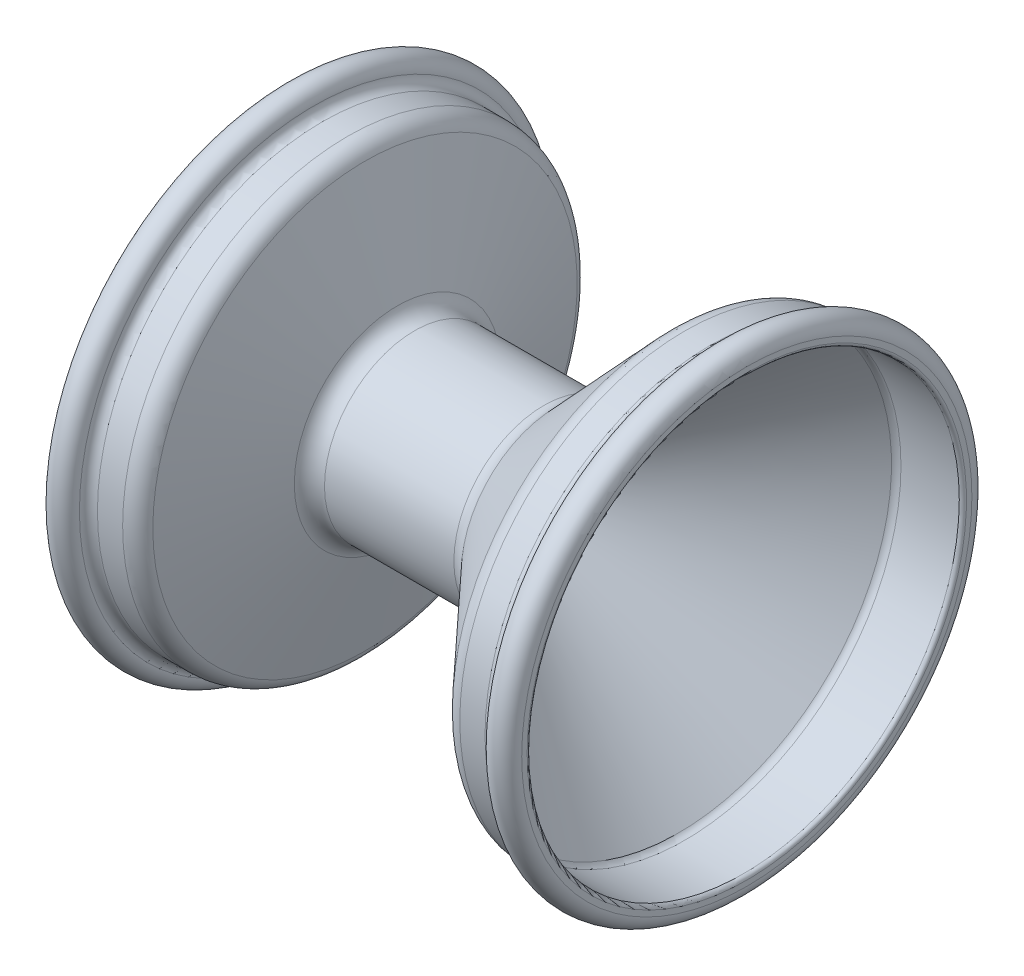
ISO-10303-21;
HEADER;
FILE_DESCRIPTION(('STEP AP214'),'2;1');
FILE_NAME('part.step','',(''),(''),'','','');
FILE_SCHEMA(('AUTOMOTIVE_DESIGN { 1 0 10303 214 1 1 1 1 }'));
ENDSEC;
DATA;
#1=APPLICATION_CONTEXT('core data for automotive mechanical design processes');
#2=APPLICATION_PROTOCOL_DEFINITION('international standard','automotive_design',2000,#1);
#3=PRODUCT_CONTEXT('',#1,'mechanical');
#4=PRODUCT('Part','Part','',(#3));
#5=PRODUCT_RELATED_PRODUCT_CATEGORY('part','',(#4));
#6=PRODUCT_DEFINITION_FORMATION('','',#4);
#7=PRODUCT_DEFINITION_CONTEXT('part definition',#1,'design');
#8=PRODUCT_DEFINITION('design','',#6,#7);
#9=PRODUCT_DEFINITION_SHAPE('','',#8);
#10=(LENGTH_UNIT() NAMED_UNIT(*) SI_UNIT(.MILLI.,.METRE.));
#11=(NAMED_UNIT(*) PLANE_ANGLE_UNIT() SI_UNIT($,.RADIAN.));
#12=(NAMED_UNIT(*) SI_UNIT($,.STERADIAN.) SOLID_ANGLE_UNIT());
#13=UNCERTAINTY_MEASURE_WITH_UNIT(LENGTH_MEASURE(1.E-05),#10,'distance_accuracy_value','');
#14=(GEOMETRIC_REPRESENTATION_CONTEXT(3) GLOBAL_UNCERTAINTY_ASSIGNED_CONTEXT((#13)) GLOBAL_UNIT_ASSIGNED_CONTEXT((#10,
#11,#12)) REPRESENTATION_CONTEXT('',''));
#15=CARTESIAN_POINT('',(0.,0.,0.));
#16=DIRECTION('',(0.,0.,1.));
#17=DIRECTION('',(1.,0.,0.));
#18=AXIS2_PLACEMENT_3D('',#15,#16,#17);
#19=CARTESIAN_POINT('',(-87.8997406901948,0.,0.));
#20=DIRECTION('',(-1.,0.,0.));
#21=DIRECTION('',(0.,0.,1.));
#22=AXIS2_PLACEMENT_3D('',#19,#20,#21);
#23=TOROIDAL_SURFACE('',#22,65.,3.84453674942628);
#24=CARTESIAN_POINT('',(-84.0552039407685,0.,0.));
#25=DIRECTION('',(-1.,0.,0.));
#26=DIRECTION('',(0.,0.,1.));
#27=AXIS2_PLACEMENT_3D('',#24,#25,#26);
#28=CIRCLE('',#27,65.);
#29=CARTESIAN_POINT('',(-84.0552039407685,0.,65.));
#30=VERTEX_POINT('',#29);
#31=EDGE_CURVE('E38',#30,#30,#28,.T.);
#32=ORIENTED_EDGE('',*,*,#31,.T.);
#33=EDGE_LOOP('',(#32));
#34=FACE_BOUND('',#33,.T.);
#35=CARTESIAN_POINT('',(-91.7442774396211,0.,0.));
#36=DIRECTION('',(-1.,0.,0.));
#37=DIRECTION('',(0.,0.,1.));
#38=AXIS2_PLACEMENT_3D('',#35,#36,#37);
#39=CIRCLE('',#38,65.);
#40=CARTESIAN_POINT('',(-91.7442774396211,0.,65.));
#41=VERTEX_POINT('',#40);
#42=EDGE_CURVE('E132',#41,#41,#39,.T.);
#43=ORIENTED_EDGE('',*,*,#42,.F.);
#44=EDGE_LOOP('',(#43));
#45=FACE_BOUND('',#44,.T.);
#46=ADVANCED_FACE('F28',(#34,#45),#23,.T.);
#47=CARTESIAN_POINT('',(-81.5552039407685,0.,0.));
#48=DIRECTION('',(-1.,0.,0.));
#49=DIRECTION('',(0.,0.,1.));
#50=AXIS2_PLACEMENT_3D('',#47,#48,#49);
#51=TOROIDAL_SURFACE('',#50,65.,2.5);
#52=CARTESIAN_POINT('',(-81.5552039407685,0.,0.));
#53=DIRECTION('',(-1.,0.,0.));
#54=DIRECTION('',(0.,0.,1.));
#55=AXIS2_PLACEMENT_3D('',#52,#53,#54);
#56=CIRCLE('',#55,62.5);
#57=CARTESIAN_POINT('',(-81.5552039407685,0.,62.5));
#58=VERTEX_POINT('',#57);
#59=EDGE_CURVE('E42',#58,#58,#56,.T.);
#60=ORIENTED_EDGE('',*,*,#59,.T.);
#61=EDGE_LOOP('',(#60));
#62=FACE_BOUND('',#61,.T.);
#63=ORIENTED_EDGE('',*,*,#31,.F.);
#64=EDGE_LOOP('',(#63));
#65=FACE_BOUND('',#64,.T.);
#66=ADVANCED_FACE('F208',(#62,#65),#51,.F.);
#67=CARTESIAN_POINT('',(-112.,0.,0.));
#68=DIRECTION('',(-1.,0.,0.));
#69=DIRECTION('',(0.,0.,1.));
#70=AXIS2_PLACEMENT_3D('',#67,#68,#69);
#71=CYLINDRICAL_SURFACE('',#70,62.5);
#72=CARTESIAN_POINT('',(-74.5552039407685,0.,0.));
#73=DIRECTION('',(-1.,0.,0.));
#74=DIRECTION('',(0.,0.,1.));
#75=AXIS2_PLACEMENT_3D('',#72,#73,#74);
#76=CIRCLE('',#75,62.5);
#77=CARTESIAN_POINT('',(-74.5552039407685,0.,62.5));
#78=VERTEX_POINT('',#77);
#79=EDGE_CURVE('E46',#78,#78,#76,.T.);
#80=ORIENTED_EDGE('',*,*,#79,.T.);
#81=EDGE_LOOP('',(#80));
#82=FACE_BOUND('',#81,.T.);
#83=ORIENTED_EDGE('',*,*,#59,.F.);
#84=EDGE_LOOP('',(#83));
#85=FACE_BOUND('',#84,.T.);
#86=ADVANCED_FACE('F212',(#82,#85),#71,.T.);
#87=CARTESIAN_POINT('',(-74.5552039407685,0.,0.));
#88=DIRECTION('',(-1.,0.,0.));
#89=DIRECTION('',(0.,0.,1.));
#90=AXIS2_PLACEMENT_3D('',#87,#88,#89);
#91=TOROIDAL_SURFACE('',#90,57.5,5.);
#92=ORIENTED_EDGE('',*,*,#79,.F.);
#93=EDGE_LOOP('',(#92));
#94=FACE_BOUND('',#93,.T.);
#95=CARTESIAN_POINT('',(-69.7599227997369,0.,0.));
#96=DIRECTION('',(-1.,0.,0.));
#97=DIRECTION('',(0.,0.,1.));
#98=AXIS2_PLACEMENT_3D('',#95,#96,#97);
#99=CIRCLE('',#98,58.9160786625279);
#100=CARTESIAN_POINT('',(-69.7599227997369,0.,58.9160786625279));
#101=VERTEX_POINT('',#100);
#102=EDGE_CURVE('E51',#101,#101,#99,.T.);
#103=ORIENTED_EDGE('',*,*,#102,.T.);
#104=EDGE_LOOP('',(#103));
#105=FACE_BOUND('',#104,.T.);
#106=ADVANCED_FACE('F220',(#94,#105),#91,.T.);
#107=CARTESIAN_POINT('',(-69.7599227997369,0.,0.));
#108=DIRECTION('',(-1.,0.,0.));
#109=DIRECTION('',(0.,0.,1.));
#110=AXIS2_PLACEMENT_3D('',#107,#108,#109);
#111=CONICAL_SURFACE('',#110,58.9160786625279,1.28365085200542);
#112=CARTESIAN_POINT('',(-60.8026334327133,0.,0.));
#113=DIRECTION('',(-1.,0.,0.));
#114=DIRECTION('',(0.,0.,1.));
#115=AXIS2_PLACEMENT_3D('',#112,#113,#114);
#116=CIRCLE('',#115,28.5839213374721);
#117=CARTESIAN_POINT('',(-60.8026334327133,0.,28.5839213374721));
#118=VERTEX_POINT('',#117);
#119=EDGE_CURVE('E54',#118,#118,#116,.T.);
#120=ORIENTED_EDGE('',*,*,#119,.T.);
#121=EDGE_LOOP('',(#120));
#122=FACE_BOUND('',#121,.T.);
#123=ORIENTED_EDGE('',*,*,#102,.F.);
#124=EDGE_LOOP('',(#123));
#125=FACE_BOUND('',#124,.T.);
#126=ADVANCED_FACE('F227',(#122,#125),#111,.T.);
#127=CARTESIAN_POINT('',(-56.0073522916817,0.,0.));
#128=DIRECTION('',(-1.,0.,0.));
#129=DIRECTION('',(0.,0.,1.));
#130=AXIS2_PLACEMENT_3D('',#127,#128,#129);
#131=TOROIDAL_SURFACE('',#130,30.,5.);
#132=ORIENTED_EDGE('',*,*,#119,.F.);
#133=EDGE_LOOP('',(#132));
#134=FACE_BOUND('',#133,.T.);
#135=CARTESIAN_POINT('',(-56.0073522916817,0.,0.));
#136=DIRECTION('',(-1.,0.,0.));
#137=DIRECTION('',(0.,0.,1.));
#138=AXIS2_PLACEMENT_3D('',#135,#136,#137);
#139=CIRCLE('',#138,25.);
#140=CARTESIAN_POINT('',(-56.0073522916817,0.,25.));
#141=VERTEX_POINT('',#140);
#142=EDGE_CURVE('E57',#141,#141,#139,.T.);
#143=ORIENTED_EDGE('',*,*,#142,.T.);
#144=EDGE_LOOP('',(#143));
#145=FACE_BOUND('',#144,.T.);
#146=ADVANCED_FACE('F231',(#134,#145),#131,.F.);
#147=CARTESIAN_POINT('',(-112.,0.,0.));
#148=DIRECTION('',(-1.,0.,0.));
#149=DIRECTION('',(0.,0.,1.));
#150=AXIS2_PLACEMENT_3D('',#147,#148,#149);
#151=CYLINDRICAL_SURFACE('',#150,25.);
#152=CARTESIAN_POINT('',(-20.0902180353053,0.,0.));
#153=DIRECTION('',(-1.,0.,0.));
#154=DIRECTION('',(0.,0.,1.));
#155=AXIS2_PLACEMENT_3D('',#152,#153,#154);
#156=CIRCLE('',#155,25.);
#157=CARTESIAN_POINT('',(-20.0902180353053,0.,25.));
#158=VERTEX_POINT('',#157);
#159=EDGE_CURVE('E60',#158,#158,#156,.T.);
#160=ORIENTED_EDGE('',*,*,#159,.T.);
#161=EDGE_LOOP('',(#160));
#162=FACE_BOUND('',#161,.T.);
#163=ORIENTED_EDGE('',*,*,#142,.F.);
#164=EDGE_LOOP('',(#163));
#165=FACE_BOUND('',#164,.T.);
#166=ADVANCED_FACE('F235',(#162,#165),#151,.T.);
#167=CARTESIAN_POINT('',(-20.0902180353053,0.,0.));
#168=DIRECTION('',(-1.,0.,0.));
#169=DIRECTION('',(0.,0.,1.));
#170=AXIS2_PLACEMENT_3D('',#167,#168,#169);
#171=TOROIDAL_SURFACE('',#170,30.,5.);
#172=ORIENTED_EDGE('',*,*,#159,.F.);
#173=EDGE_LOOP('',(#172));
#174=FACE_BOUND('',#173,.T.);
#175=CARTESIAN_POINT('',(-16.4249052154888,0.,0.));
#176=DIRECTION('',(-1.,0.,0.));
#177=DIRECTION('',(0.,0.,1.));
#178=AXIS2_PLACEMENT_3D('',#175,#176,#177);
#179=CIRCLE('',#178,26.5991939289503);
#180=CARTESIAN_POINT('',(-16.4249052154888,0.,26.5991939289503));
#181=VERTEX_POINT('',#180);
#182=EDGE_CURVE('E63',#181,#181,#179,.T.);
#183=ORIENTED_EDGE('',*,*,#182,.T.);
#184=EDGE_LOOP('',(#183));
#185=FACE_BOUND('',#184,.T.);
#186=ADVANCED_FACE('F239',(#174,#185),#171,.F.);
#187=CARTESIAN_POINT('',(15.4013362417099,0.,0.));
#188=DIRECTION('',(1.,0.,0.));
#189=DIRECTION('',(0.,0.,-1.));
#190=AXIS2_PLACEMENT_3D('',#187,#188,#189);
#191=CONICAL_SURFACE('',#190,60.9008060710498,0.822813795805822);
#192=CARTESIAN_POINT('',(3.09529375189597,47.5069200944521,-3.52649661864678));
#193=CARTESIAN_POINT('',(3.16622375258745,47.5761889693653,-3.62602737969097));
#194=CARTESIAN_POINT('',(3.23997912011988,47.6485423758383,-3.72137158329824));
#195=CARTESIAN_POINT('',(3.39258074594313,47.7990224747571,-3.90307311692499));
#196=CARTESIAN_POINT('',(3.47142827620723,47.8771506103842,-3.98942818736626));
#197=CARTESIAN_POINT('',(3.63362811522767,48.0387461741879,-4.15257100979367));
#198=CARTESIAN_POINT('',(3.71698416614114,48.1222180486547,-4.22935063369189));
#199=CARTESIAN_POINT('',(3.88751385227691,48.29394834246,-4.37273938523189));
#200=CARTESIAN_POINT('',(3.97468886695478,48.3822084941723,-4.43934479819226));
#201=CARTESIAN_POINT('',(4.15208372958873,48.5628505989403,-4.56182924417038));
#202=CARTESIAN_POINT('',(4.24230129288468,48.6552294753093,-4.61771612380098));
#203=CARTESIAN_POINT('',(4.42518569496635,48.8435946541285,-4.71844233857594));
#204=CARTESIAN_POINT('',(4.51785342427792,48.9395822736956,-4.76327759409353));
#205=CARTESIAN_POINT('',(4.70485059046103,49.1344245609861,-4.84152687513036));
#206=CARTESIAN_POINT('',(4.79917896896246,49.2332774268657,-4.87494791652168));
#207=CARTESIAN_POINT('',(4.9888904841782,49.4332630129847,-4.93017633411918));
#208=CARTESIAN_POINT('',(5.08427399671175,49.5343965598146,-4.95197942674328));
#209=CARTESIAN_POINT('',(5.27519117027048,49.7380094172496,-4.98376646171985));
#210=CARTESIAN_POINT('',(5.37072422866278,49.8404858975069,-4.9937721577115));
#211=CARTESIAN_POINT('',(5.56147149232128,50.0462757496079,-5.00196717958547));
#212=CARTESIAN_POINT('',(5.65668556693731,50.1495894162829,-5.00015214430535));
#213=CARTESIAN_POINT('',(5.84606215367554,50.3562339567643,-4.98471160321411));
#214=CARTESIAN_POINT('',(5.94022500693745,50.4595648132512,-4.97109004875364));
#215=CARTESIAN_POINT('',(6.1269207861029,50.6655589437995,-4.93213335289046));
#216=CARTESIAN_POINT('',(6.21945309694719,50.7682219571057,-4.90679388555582));
#217=CARTESIAN_POINT('',(6.40214031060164,50.9719802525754,-4.84461247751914));
#218=CARTESIAN_POINT('',(6.49229745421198,51.0730769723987,-4.80778183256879));
#219=CARTESIAN_POINT('',(6.66976570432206,51.2730837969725,-4.72286080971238));
#220=CARTESIAN_POINT('',(6.75707574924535,51.3719930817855,-4.67476628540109));
#221=CARTESIAN_POINT('',(6.92822503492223,51.566810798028,-4.56767877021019));
#222=CARTESIAN_POINT('',(7.01206552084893,51.6627203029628,-4.50868973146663));
#223=CARTESIAN_POINT('',(7.17578358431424,51.8508524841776,-4.38023103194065));
#224=CARTESIAN_POINT('',(7.25565968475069,51.9430737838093,-4.31075750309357));
#225=CARTESIAN_POINT('',(7.48877712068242,52.2133631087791,-4.08709081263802));
#226=CARTESIAN_POINT('',(7.63539272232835,52.3849254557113,-3.91772368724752));
#227=CARTESIAN_POINT('',(7.90693743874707,52.7048844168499,-3.54365695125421));
#228=CARTESIAN_POINT('',(8.03186639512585,52.8532808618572,-3.33895708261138));
#229=CARTESIAN_POINT('',(8.25730766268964,53.1225402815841,-2.89960872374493));
#230=CARTESIAN_POINT('',(8.35778631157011,53.243365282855,-2.6649196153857));
#231=CARTESIAN_POINT('',(8.53168650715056,53.4533087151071,-2.17247839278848));
#232=CARTESIAN_POINT('',(8.60510817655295,53.5424272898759,-1.9147263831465));
#233=CARTESIAN_POINT('',(8.72311912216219,53.6860096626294,-1.38370389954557));
#234=CARTESIAN_POINT('',(8.76773380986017,53.7405040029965,-1.11044733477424));
#235=CARTESIAN_POINT('',(8.8271832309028,53.8131753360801,-0.555982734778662));
#236=CARTESIAN_POINT('',(8.84201831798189,53.831352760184,-0.274774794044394));
#237=CARTESIAN_POINT('',(8.84156240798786,53.8307946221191,0.287094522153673));
#238=CARTESIAN_POINT('',(8.82632316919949,53.8121224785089,0.567756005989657));
#239=CARTESIAN_POINT('',(8.76617855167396,53.7386044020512,1.12104619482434));
#240=CARTESIAN_POINT('',(8.721273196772,53.6837584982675,1.39367490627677));
#241=CARTESIAN_POINT('',(8.60285173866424,53.5396873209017,1.92315549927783));
#242=CARTESIAN_POINT('',(8.52933759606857,53.4504644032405,2.18000846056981));
#243=CARTESIAN_POINT('',(8.35542300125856,53.2405208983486,2.67070932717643));
#244=CARTESIAN_POINT('',(8.2550222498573,53.1197999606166,2.90455697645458));
#245=CARTESIAN_POINT('',(8.0295164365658,52.8504850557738,3.34303192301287));
#246=CARTESIAN_POINT('',(7.90437015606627,52.7018446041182,3.54760947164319));
#247=CARTESIAN_POINT('',(7.63248684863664,52.3815165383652,3.92130261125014));
#248=CARTESIAN_POINT('',(7.48574965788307,52.2098287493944,4.09041793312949));
#249=CARTESIAN_POINT('',(7.17412927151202,51.8485675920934,4.38855029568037));
#250=CARTESIAN_POINT('',(7.00922791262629,51.658976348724,4.51752669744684));
#251=CARTESIAN_POINT('',(6.66557890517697,51.2678835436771,4.73146781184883));
#252=CARTESIAN_POINT('',(6.48683137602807,51.0663820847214,4.81643290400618));
#253=CARTESIAN_POINT('',(6.12041002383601,50.6578150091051,4.93983286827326));
#254=CARTESIAN_POINT('',(5.93274766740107,50.4507566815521,4.97832591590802));
#255=CARTESIAN_POINT('',(5.5533932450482,50.0369486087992,5.00786127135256));
#256=CARTESIAN_POINT('',(5.36170123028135,49.8301988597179,4.99890418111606));
#257=CARTESIAN_POINT('',(4.98004897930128,49.4233175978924,4.93385765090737));
#258=CARTESIAN_POINT('',(4.79008624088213,49.2231748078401,4.87785335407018));
#259=CARTESIAN_POINT('',(4.41707809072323,48.834643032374,4.7204204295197));
#260=CARTESIAN_POINT('',(4.23403269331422,48.6462540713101,4.61899170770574));
#261=CARTESIAN_POINT('',(3.88033258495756,48.2861722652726,4.37359442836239));
#262=CARTESIAN_POINT('',(3.70968323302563,48.1144866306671,4.22960760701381));
#263=CARTESIAN_POINT('',(3.3860951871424,47.7921676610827,3.90304453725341));
#264=CARTESIAN_POINT('',(3.23315680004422,47.6415346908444,3.72046762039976));
#265=CARTESIAN_POINT('',(3.02074680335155,47.4341293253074,3.42162023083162));
#266=CARTESIAN_POINT('',(2.95268119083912,47.3679940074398,3.31765432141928));
#267=CARTESIAN_POINT('',(2.8228098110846,47.2423245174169,3.10211983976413));
#268=CARTESIAN_POINT('',(2.76100175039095,47.1827879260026,2.99055407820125));
#269=CARTESIAN_POINT('',(2.64414434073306,47.0706412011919,2.76055861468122));
#270=CARTESIAN_POINT('',(2.58909753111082,47.0180336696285,2.64212635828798));
#271=CARTESIAN_POINT('',(2.48627200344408,46.9200822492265,2.39931120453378));
#272=CARTESIAN_POINT('',(2.43849059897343,46.8747356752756,2.27493052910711));
#273=CARTESIAN_POINT('',(2.35055549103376,46.7915095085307,2.02096657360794));
#274=CARTESIAN_POINT('',(2.31040743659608,46.7536354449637,1.89137952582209));
#275=CARTESIAN_POINT('',(2.23814903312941,46.6856196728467,1.62805804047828));
#276=CARTESIAN_POINT('',(2.20603570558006,46.6554750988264,1.49432516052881));
#277=CARTESIAN_POINT('',(2.15010422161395,46.6030585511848,1.22357462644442));
#278=CARTESIAN_POINT('',(2.12628872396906,46.5807891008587,1.08655593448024));
#279=CARTESIAN_POINT('',(2.08718842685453,46.544265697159,0.810304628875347));
#280=CARTESIAN_POINT('',(2.0719004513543,46.5300087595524,0.671072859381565));
#281=CARTESIAN_POINT('',(2.05000142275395,46.5095960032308,0.391617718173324));
#282=CARTESIAN_POINT('',(2.04337325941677,46.5034242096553,0.251396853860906));
#283=CARTESIAN_POINT('',(2.03879863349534,46.4991639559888,-0.0292570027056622));
#284=CARTESIAN_POINT('',(2.04084895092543,46.5010724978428,-0.16968989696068));
#285=CARTESIAN_POINT('',(2.05360932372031,46.5129593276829,-0.449903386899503));
#286=CARTESIAN_POINT('',(2.06432457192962,46.5229424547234,-0.589683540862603));
#287=CARTESIAN_POINT('',(2.0943190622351,46.5509248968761,-0.867459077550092));
#288=CARTESIAN_POINT('',(2.11359515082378,46.5689212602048,-1.00545509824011));
#289=CARTESIAN_POINT('',(2.16053006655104,46.6128240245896,-1.27868972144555));
#290=CARTESIAN_POINT('',(2.18818619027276,46.6387278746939,-1.41392919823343));
#291=CARTESIAN_POINT('',(2.25162528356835,46.6982941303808,-1.68068837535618));
#292=CARTESIAN_POINT('',(2.28740529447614,46.7319537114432,-1.81220941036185));
#293=CARTESIAN_POINT('',(2.36675140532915,46.8068210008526,-2.07054849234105));
#294=CARTESIAN_POINT('',(2.41031100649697,46.8480224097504,-2.19737035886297));
#295=CARTESIAN_POINT('',(2.5048407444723,46.937746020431,-2.44549282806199));
#296=CARTESIAN_POINT('',(2.55580904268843,46.9862664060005,-2.56679479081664));
#297=CARTESIAN_POINT('',(2.68027376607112,47.1052196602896,-2.83676939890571));
#298=CARTESIAN_POINT('',(2.7560508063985,47.177956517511,-2.98338993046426));
#299=CARTESIAN_POINT('',(2.91810247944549,47.3344130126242,-3.26446531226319));
#300=CARTESIAN_POINT('',(3.00437713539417,47.4181326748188,-3.3989201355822));
#301=CARTESIAN_POINT('',(3.09529375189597,47.5069200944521,-3.52649661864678));
#302=B_SPLINE_CURVE_WITH_KNOTS('',3,(#192,#193,#194,#195,#196,#197,#198,#199,#200,#201,#202,
#203,#204,#205,#206,#207,#208,#209,#210,#211,#212,#213,#214,#215,#216,#217,#218,#219,#220,#221,
#222,#223,#224,#225,#226,#227,#228,#229,#230,#231,#232,#233,#234,#235,#236,#237,#238,#239,#240,
#241,#242,#243,#244,#245,#246,#247,#248,#249,#250,#251,#252,#253,#254,#255,#256,#257,#258,#259,
#260,#261,#262,#263,#264,#265,#266,#267,#268,#269,#270,#271,#272,#273,#274,#275,#276,#277,#278,
#279,#280,#281,#282,#283,#284,#285,#286,#287,#288,#289,#290,#291,#292,#293,#294,#295,#296,#297,
#298,#299,#300,#301),.UNSPECIFIED.,.T.,.F.,(4,2,2,2,2,2,2,2,2,2,2,2,2,2,2,2,2,2,2,2,2,2,2,2,2,2,
2,2,2,2,2,2,2,2,2,2,2,2,2,2,2,2,2,2,2,2,2,2,2,2,2,2,2,2,4),(0.,0.421293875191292,
0.842693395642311,1.26444821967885,1.6863566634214,2.10795505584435,2.52970884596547,
2.95120293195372,3.37285231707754,3.79372298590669,4.21474894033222,4.63563404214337,
5.05667464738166,5.47730266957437,5.89808577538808,6.3187165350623,6.73950286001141,
7.58163434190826,8.42377197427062,9.26706255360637,10.110349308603,10.9528911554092,
11.7954229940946,12.6365060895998,13.4775885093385,14.3186132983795,15.1596474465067,
16.0020944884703,16.8445479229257,17.687851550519,18.531147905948,19.3733874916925,
20.215616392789,21.056324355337,21.897034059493,22.7381050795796,23.5791906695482,
24.0010855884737,24.4228253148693,24.8447229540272,25.2664642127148,25.6885163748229,
26.1104118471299,26.5324423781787,26.9543156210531,27.3753540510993,27.7962362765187,
28.2173709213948,28.638350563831,29.0591945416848,29.4798854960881,29.9002266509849,
30.3204636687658,30.8604683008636,31.4004741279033),.UNSPECIFIED.);
#303=CARTESIAN_POINT('',(3.09529375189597,47.5069200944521,-3.52649661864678));
#304=VERTEX_POINT('',#303);
#305=EDGE_CURVE('E10',#304,#304,#302,.T.);
#306=ORIENTED_EDGE('',*,*,#305,.T.);
#307=EDGE_LOOP('',(#306));
#308=FACE_BOUND('',#307,.T.);
#309=ORIENTED_EDGE('',*,*,#182,.F.);
#310=EDGE_LOOP('',(#309));
#311=FACE_BOUND('',#310,.T.);
#312=CARTESIAN_POINT('',(15.4013362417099,0.,0.));
#313=DIRECTION('',(-1.,0.,0.));
#314=DIRECTION('',(0.,0.,1.));
#315=AXIS2_PLACEMENT_3D('',#312,#313,#314);
#316=CIRCLE('',#315,60.9008060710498);
#317=CARTESIAN_POINT('',(15.4013362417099,0.,60.9008060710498));
#318=VERTEX_POINT('',#317);
#319=EDGE_CURVE('E66',#318,#318,#316,.T.);
#320=ORIENTED_EDGE('',*,*,#319,.T.);
#321=EDGE_LOOP('',(#320));
#322=FACE_BOUND('',#321,.T.);
#323=ADVANCED_FACE('F242',(#308,#311,#322),#191,.T.);
#324=CARTESIAN_POINT('',(19.0666490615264,0.,0.));
#325=DIRECTION('',(-1.,0.,0.));
#326=DIRECTION('',(0.,0.,1.));
#327=AXIS2_PLACEMENT_3D('',#324,#325,#326);
#328=TOROIDAL_SURFACE('',#327,57.5,5.);
#329=ORIENTED_EDGE('',*,*,#319,.F.);
#330=EDGE_LOOP('',(#329));
#331=FACE_BOUND('',#330,.T.);
#332=CARTESIAN_POINT('',(19.0666490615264,0.,0.));
#333=DIRECTION('',(-1.,0.,0.));
#334=DIRECTION('',(0.,0.,1.));
#335=AXIS2_PLACEMENT_3D('',#332,#333,#334);
#336=CIRCLE('',#335,62.5);
#337=CARTESIAN_POINT('',(19.0666490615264,0.,62.5));
#338=VERTEX_POINT('',#337);
#339=EDGE_CURVE('E69',#338,#338,#336,.T.);
#340=ORIENTED_EDGE('',*,*,#339,.T.);
#341=EDGE_LOOP('',(#340));
#342=FACE_BOUND('',#341,.T.);
#343=ADVANCED_FACE('F247',(#331,#342),#328,.T.);
#344=CARTESIAN_POINT('',(-112.,0.,0.));
#345=DIRECTION('',(-1.,0.,0.));
#346=DIRECTION('',(0.,0.,1.));
#347=AXIS2_PLACEMENT_3D('',#344,#345,#346);
#348=CYLINDRICAL_SURFACE('',#347,62.5);
#349=ORIENTED_EDGE('',*,*,#339,.F.);
#350=EDGE_LOOP('',(#349));
#351=FACE_BOUND('',#350,.T.);
#352=CARTESIAN_POINT('',(26.0666490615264,0.,0.));
#353=DIRECTION('',(-1.,0.,0.));
#354=DIRECTION('',(0.,0.,1.));
#355=AXIS2_PLACEMENT_3D('',#352,#353,#354);
#356=CIRCLE('',#355,62.5);
#357=CARTESIAN_POINT('',(26.0666490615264,0.,62.5));
#358=VERTEX_POINT('',#357);
#359=EDGE_CURVE('E72',#358,#358,#356,.T.);
#360=ORIENTED_EDGE('',*,*,#359,.T.);
#361=EDGE_LOOP('',(#360));
#362=FACE_BOUND('',#361,.T.);
#363=ADVANCED_FACE('F250',(#351,#362),#348,.T.);
#364=CARTESIAN_POINT('',(26.0666490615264,0.,0.));
#365=DIRECTION('',(-1.,0.,0.));
#366=DIRECTION('',(0.,0.,1.));
#367=AXIS2_PLACEMENT_3D('',#364,#365,#366);
#368=TOROIDAL_SURFACE('',#367,65.,2.5);
#369=ORIENTED_EDGE('',*,*,#359,.F.);
#370=EDGE_LOOP('',(#369));
#371=FACE_BOUND('',#370,.T.);
#372=CARTESIAN_POINT('',(28.3798170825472,0.,0.));
#373=DIRECTION('',(-1.,0.,0.));
#374=DIRECTION('',(0.,0.,1.));
#375=AXIS2_PLACEMENT_3D('',#372,#373,#374);
#376=CIRCLE('',#375,64.0517101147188);
#377=CARTESIAN_POINT('',(28.3798170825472,0.,64.0517101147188));
#378=VERTEX_POINT('',#377);
#379=EDGE_CURVE('E75',#378,#378,#376,.T.);
#380=ORIENTED_EDGE('',*,*,#379,.T.);
#381=EDGE_LOOP('',(#380));
#382=FACE_BOUND('',#381,.T.);
#383=ADVANCED_FACE('F254',(#371,#382),#368,.F.);
#384=CARTESIAN_POINT('',(32.1649109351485,0.,0.));
#385=DIRECTION('',(-1.,0.,0.));
#386=DIRECTION('',(0.,0.,1.));
#387=AXIS2_PLACEMENT_3D('',#384,#385,#386);
#388=TOROIDAL_SURFACE('',#387,62.5,4.09081162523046);
#389=ORIENTED_EDGE('',*,*,#379,.F.);
#390=EDGE_LOOP('',(#389));
#391=FACE_BOUND('',#390,.T.);
#392=CARTESIAN_POINT('',(36.2557225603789,0.,0.));
#393=DIRECTION('',(-1.,0.,0.));
#394=DIRECTION('',(0.,0.,1.));
#395=AXIS2_PLACEMENT_3D('',#392,#393,#394);
#396=CIRCLE('',#395,62.5);
#397=CARTESIAN_POINT('',(36.2557225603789,0.,62.5));
#398=VERTEX_POINT('',#397);
#399=EDGE_CURVE('E78',#398,#398,#396,.T.);
#400=ORIENTED_EDGE('',*,*,#399,.T.);
#401=EDGE_LOOP('',(#400));
#402=FACE_BOUND('',#401,.T.);
#403=ADVANCED_FACE('F258',(#391,#402),#388,.T.);
#404=CARTESIAN_POINT('',(36.2557225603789,62.5,0.));
#405=DIRECTION('',(1.,0.,0.));
#406=DIRECTION('',(0.,0.,-1.));
#407=AXIS2_PLACEMENT_3D('',#404,#405,#406);
#408=PLANE('',#407);
#409=CARTESIAN_POINT('',(36.2557225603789,0.,0.));
#410=DIRECTION('',(-1.,0.,0.));
#411=DIRECTION('',(0.,0.,1.));
#412=AXIS2_PLACEMENT_3D('',#409,#410,#411);
#413=CIRCLE('',#412,61.);
#414=CARTESIAN_POINT('',(36.2557225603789,0.,61.));
#415=VERTEX_POINT('',#414);
#416=EDGE_CURVE('E81',#415,#415,#413,.T.);
#417=ORIENTED_EDGE('',*,*,#416,.T.);
#418=EDGE_LOOP('',(#417));
#419=FACE_BOUND('',#418,.T.);
#420=ORIENTED_EDGE('',*,*,#399,.F.);
#421=EDGE_LOOP('',(#420));
#422=FACE_BOUND('',#421,.T.);
#423=ADVANCED_FACE('F262',(#419,#422),#408,.T.);
#424=CARTESIAN_POINT('',(35.2557225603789,0.,0.));
#425=DIRECTION('',(-1.,0.,0.));
#426=DIRECTION('',(0.,0.,1.));
#427=AXIS2_PLACEMENT_3D('',#424,#425,#426);
#428=TOROIDAL_SURFACE('',#427,61.,0.999999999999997);
#429=ORIENTED_EDGE('',*,*,#416,.F.);
#430=EDGE_LOOP('',(#429));
#431=FACE_BOUND('',#430,.T.);
#432=CARTESIAN_POINT('',(35.2557225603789,0.,0.));
#433=DIRECTION('',(-1.,0.,0.));
#434=DIRECTION('',(0.,0.,1.));
#435=AXIS2_PLACEMENT_3D('',#432,#433,#434);
#436=CIRCLE('',#435,60.);
#437=CARTESIAN_POINT('',(35.2557225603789,0.,60.));
#438=VERTEX_POINT('',#437);
#439=EDGE_CURVE('E84',#438,#438,#436,.T.);
#440=ORIENTED_EDGE('',*,*,#439,.T.);
#441=EDGE_LOOP('',(#440));
#442=FACE_BOUND('',#441,.T.);
#443=ADVANCED_FACE('F266',(#431,#442),#428,.T.);
#444=CARTESIAN_POINT('',(-112.,0.,0.));
#445=DIRECTION('',(-1.,0.,0.));
#446=DIRECTION('',(0.,0.,1.));
#447=AXIS2_PLACEMENT_3D('',#444,#445,#446);
#448=CYLINDRICAL_SURFACE('',#447,60.);
#449=CARTESIAN_POINT('',(19.0666490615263,0.,0.));
#450=DIRECTION('',(-1.,0.,0.));
#451=DIRECTION('',(0.,0.,1.));
#452=AXIS2_PLACEMENT_3D('',#449,#450,#451);
#453=CIRCLE('',#452,60.);
#454=CARTESIAN_POINT('',(19.0666490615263,0.,60.));
#455=VERTEX_POINT('',#454);
#456=EDGE_CURVE('E87',#455,#455,#453,.T.);
#457=ORIENTED_EDGE('',*,*,#456,.T.);
#458=EDGE_LOOP('',(#457));
#459=FACE_BOUND('',#458,.T.);
#460=ORIENTED_EDGE('',*,*,#439,.F.);
#461=EDGE_LOOP('',(#460));
#462=FACE_BOUND('',#461,.T.);
#463=ADVANCED_FACE('F270',(#459,#462),#448,.F.);
#464=CARTESIAN_POINT('',(19.0666490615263,0.,0.));
#465=DIRECTION('',(-1.,0.,0.));
#466=DIRECTION('',(0.,0.,1.));
#467=AXIS2_PLACEMENT_3D('',#464,#465,#466);
#468=TOROIDAL_SURFACE('',#467,57.5,2.5);
#469=CARTESIAN_POINT('',(17.2339926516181,0.,0.));
#470=DIRECTION('',(-1.,0.,0.));
#471=DIRECTION('',(0.,0.,1.));
#472=AXIS2_PLACEMENT_3D('',#469,#470,#471);
#473=CIRCLE('',#472,59.2004030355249);
#474=CARTESIAN_POINT('',(17.2339926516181,0.,59.2004030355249));
#475=VERTEX_POINT('',#474);
#476=EDGE_CURVE('E90',#475,#475,#473,.T.);
#477=ORIENTED_EDGE('',*,*,#476,.T.);
#478=EDGE_LOOP('',(#477));
#479=FACE_BOUND('',#478,.T.);
#480=ORIENTED_EDGE('',*,*,#456,.F.);
#481=EDGE_LOOP('',(#480));
#482=FACE_BOUND('',#481,.T.);
#483=ADVANCED_FACE('F203',(#479,#482),#468,.F.);
#484=CARTESIAN_POINT('',(17.2339926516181,0.,0.));
#485=DIRECTION('',(1.,0.,0.));
#486=DIRECTION('',(0.,0.,-1.));
#487=AXIS2_PLACEMENT_3D('',#484,#485,#486);
#488=CONICAL_SURFACE('',#487,59.2004030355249,0.822813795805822);
#489=CARTESIAN_POINT('',(4.32004026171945,45.2186427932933,-2.3951850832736));
#490=CARTESIAN_POINT('',(4.36905776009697,45.2650117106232,-2.51856599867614));
#491=CARTESIAN_POINT('',(4.42177167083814,45.3150369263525,-2.63908332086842));
#492=CARTESIAN_POINT('',(4.53416349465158,45.422144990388,-2.87361199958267));
#493=CARTESIAN_POINT('',(4.59384318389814,45.4792296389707,-2.98762168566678));
#494=CARTESIAN_POINT('',(4.71969849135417,45.600169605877,-3.20838073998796));
#495=CARTESIAN_POINT('',(4.78587969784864,45.6640307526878,-3.31512372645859));
#496=CARTESIAN_POINT('',(4.92416512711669,45.798136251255,-3.52052610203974));
#497=CARTESIAN_POINT('',(4.99627150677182,45.8683829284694,-3.61918252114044));
#498=CARTESIAN_POINT('',(5.14572901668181,46.0147614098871,-3.80759089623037));
#499=CARTESIAN_POINT('',(5.2230758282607,46.0908883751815,-3.89735003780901));
#500=CARTESIAN_POINT('',(5.38246810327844,46.2486437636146,-4.06744953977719));
#501=CARTESIAN_POINT('',(5.46451528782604,46.3302742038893,-4.14778641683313));
#502=CARTESIAN_POINT('',(5.63257451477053,46.4984505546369,-4.29838363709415));
#503=CARTESIAN_POINT('',(5.71858407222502,46.5849933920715,-4.36865018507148));
#504=CARTESIAN_POINT('',(5.8939722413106,46.7625212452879,-4.49868765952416));
#505=CARTESIAN_POINT('',(5.98335208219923,46.8535078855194,-4.55845471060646));
#506=CARTESIAN_POINT('',(6.16467455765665,47.0392109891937,-4.66698102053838));
#507=CARTESIAN_POINT('',(6.25661469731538,47.1339238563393,-4.71575060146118));
#508=CARTESIAN_POINT('',(6.44247544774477,47.3265623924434,-4.80201902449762));
#509=CARTESIAN_POINT('',(6.53639677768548,47.4244892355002,-4.83951369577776));
#510=CARTESIAN_POINT('',(6.72545381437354,47.6228184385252,-4.90292639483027));
#511=CARTESIAN_POINT('',(6.82058909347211,47.7232199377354,-4.92884838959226));
#512=CARTESIAN_POINT('',(7.0114441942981,47.9258674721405,-4.96895484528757));
#513=CARTESIAN_POINT('',(7.10716421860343,48.028114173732,-4.98313497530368));
#514=CARTESIAN_POINT('',(7.29821187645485,48.2334160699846,-4.99961696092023));
#515=CARTESIAN_POINT('',(7.39353987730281,48.3364684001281,-5.00195022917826));
#516=CARTESIAN_POINT('',(7.58342218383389,48.5429429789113,-4.99480728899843));
#517=CARTESIAN_POINT('',(7.67797619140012,48.646365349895,-4.98532672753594));
#518=CARTESIAN_POINT('',(7.86559606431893,48.852756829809,-4.95461739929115));
#519=CARTESIAN_POINT('',(7.95866247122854,48.9557260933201,-4.93339301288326));
#520=CARTESIAN_POINT('',(8.14272098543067,49.1604930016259,-4.87936469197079));
#521=CARTESIAN_POINT('',(8.23371231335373,49.2622901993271,-4.84655648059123));
#522=CARTESIAN_POINT('',(8.50255992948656,49.5646681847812,-4.73108611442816));
#523=CARTESIAN_POINT('',(8.67651937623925,49.7624882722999,-4.63134029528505));
#524=CARTESIAN_POINT('',(9.00909327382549,50.14424485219,-4.38922905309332));
#525=CARTESIAN_POINT('',(9.16770755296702,50.3281811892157,-4.2468631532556));
#526=CARTESIAN_POINT('',(9.4660910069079,50.6770046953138,-3.92317369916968));
#527=CARTESIAN_POINT('',(9.60582121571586,50.8418523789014,-3.74177153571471));
#528=CARTESIAN_POINT('',(9.86263716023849,51.1468581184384,-3.34531493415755));
#529=CARTESIAN_POINT('',(9.97972270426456,51.2870159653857,-3.13026021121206));
#530=CARTESIAN_POINT('',(10.188593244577,51.5383328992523,-2.67230598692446));
#531=CARTESIAN_POINT('',(10.2803499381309,51.6494595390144,-2.42937576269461));
#532=CARTESIAN_POINT('',(10.4362255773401,51.8389121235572,-1.92274616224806));
#533=CARTESIAN_POINT('',(10.5003447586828,51.9172383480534,-1.65904696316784));
#534=CARTESIAN_POINT('',(10.5993817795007,52.0384517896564,-1.11871816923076));
#535=CARTESIAN_POINT('',(10.6343367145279,52.0813840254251,-0.842105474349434));
#536=CARTESIAN_POINT('',(10.6743666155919,52.1305630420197,-0.283510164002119));
#537=CARTESIAN_POINT('',(10.6794419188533,52.1368102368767,-0.00152760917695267));
#538=CARTESIAN_POINT('',(10.6596120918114,52.1124348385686,0.559295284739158));
#539=CARTESIAN_POINT('',(10.634757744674,52.0818746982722,0.838140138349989));
#540=CARTESIAN_POINT('',(10.5557317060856,51.9849940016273,1.38526163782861));
#541=CARTESIAN_POINT('',(10.5015599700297,51.9186733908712,1.65353826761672));
#542=CARTESIAN_POINT('',(10.3651381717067,51.752410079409,2.17201492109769));
#543=CARTESIAN_POINT('',(10.2828792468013,51.6524567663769,2.42220920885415));
#544=CARTESIAN_POINT('',(10.092208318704,51.4221608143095,2.89737521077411));
#545=CARTESIAN_POINT('',(9.98379598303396,51.2918177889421,3.12234660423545));
#546=CARTESIAN_POINT('',(9.74314654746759,51.0046255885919,3.54113096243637));
#547=CARTESIAN_POINT('',(9.61086505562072,50.8477270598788,3.73488457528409));
#548=CARTESIAN_POINT('',(9.32579506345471,50.512542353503,4.08524827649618));
#549=CARTESIAN_POINT('',(9.17300644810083,50.3342560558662,4.24185815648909));
#550=CARTESIAN_POINT('',(8.85057068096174,49.9617010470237,4.5135914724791));
#551=CARTESIAN_POINT('',(8.68091136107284,49.7674208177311,4.62868468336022));
#552=CARTESIAN_POINT('',(8.32915455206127,49.3689464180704,4.81393021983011));
#553=CARTESIAN_POINT('',(8.14705719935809,49.1647523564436,4.88408303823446));
#554=CARTESIAN_POINT('',(7.77555375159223,48.7529365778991,4.9773509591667));
#555=CARTESIAN_POINT('',(7.58616012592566,48.5453210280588,5.0005429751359));
#556=CARTESIAN_POINT('',(7.20497971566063,48.1324163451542,4.99943782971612));
#557=CARTESIAN_POINT('',(7.01319296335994,47.927127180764,4.97514130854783));
#558=CARTESIAN_POINT('',(6.63306048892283,47.525087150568,4.87987047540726));
#559=CARTESIAN_POINT('',(6.44470943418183,47.3283222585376,4.80897620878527));
#560=CARTESIAN_POINT('',(6.07655623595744,46.9482079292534,4.62251142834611));
#561=CARTESIAN_POINT('',(5.89675416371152,46.7648586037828,4.50694054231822));
#562=CARTESIAN_POINT('',(5.63773172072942,46.5036201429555,4.3027201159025));
#563=CARTESIAN_POINT('',(5.55309273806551,46.418761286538,4.2294149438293));
#564=CARTESIAN_POINT('',(5.38802178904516,46.254151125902,4.07301342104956));
#565=CARTESIAN_POINT('',(5.30758829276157,46.1743979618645,3.98992066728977));
#566=CARTESIAN_POINT('',(5.15153945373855,46.0204605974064,3.81449226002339));
#567=CARTESIAN_POINT('',(5.07592597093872,45.9462785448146,3.72215307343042));
#568=CARTESIAN_POINT('',(4.93018329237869,45.8039800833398,3.52894191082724));
#569=CARTESIAN_POINT('',(4.86005209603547,45.735861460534,3.42807307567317));
#570=CARTESIAN_POINT('',(4.72564667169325,45.605890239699,3.21820732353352));
#571=CARTESIAN_POINT('',(4.66138841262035,45.5440546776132,3.1091896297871));
#572=CARTESIAN_POINT('',(4.53950216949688,45.4272342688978,2.88407395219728));
#573=CARTESIAN_POINT('',(4.48187175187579,45.3722469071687,2.76797859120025));
#574=CARTESIAN_POINT('',(4.37368939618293,45.2693918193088,2.52945192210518));
#575=CARTESIAN_POINT('',(4.32313981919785,45.221526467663,2.4070185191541));
#576=CARTESIAN_POINT('',(4.22959912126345,45.1332218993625,2.15676472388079));
#577=CARTESIAN_POINT('',(4.18660519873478,45.0927799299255,2.02894635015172));
#578=CARTESIAN_POINT('',(4.10852786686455,45.0195200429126,1.76877248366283));
#579=CARTESIAN_POINT('',(4.07344529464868,44.9867029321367,1.6364165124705));
#580=CARTESIAN_POINT('',(4.01152144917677,44.9288889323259,1.36817128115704));
#581=CARTESIAN_POINT('',(3.98467711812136,44.9038891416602,1.23228335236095));
#582=CARTESIAN_POINT('',(3.9394409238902,44.8618167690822,0.957813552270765));
#583=CARTESIAN_POINT('',(3.92105407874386,44.8447488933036,0.819230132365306));
#584=CARTESIAN_POINT('',(3.89292899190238,44.818659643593,0.540490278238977));
#585=CARTESIAN_POINT('',(3.88318753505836,44.8096352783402,0.4003344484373));
#586=CARTESIAN_POINT('',(3.87244002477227,44.7996796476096,0.119645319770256));
#587=CARTESIAN_POINT('',(3.87141886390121,44.7987343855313,-0.0208869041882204));
#588=CARTESIAN_POINT('',(3.878080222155,44.8049040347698,-0.301515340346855));
#589=CARTESIAN_POINT('',(3.88575954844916,44.8120159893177,-0.441611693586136));
#590=CARTESIAN_POINT('',(3.90973752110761,44.8342484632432,-0.720306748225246));
#591=CARTESIAN_POINT('',(3.9260288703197,44.8493622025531,-0.858906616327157));
#592=CARTESIAN_POINT('',(3.96707004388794,44.8875047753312,-1.13369826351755));
#593=CARTESIAN_POINT('',(3.99181774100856,44.9105316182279,-1.26989063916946));
#594=CARTESIAN_POINT('',(4.05756472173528,44.9718509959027,-1.57626583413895));
#595=CARTESIAN_POINT('',(4.10116712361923,45.01260559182,-1.74540928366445));
#596=CARTESIAN_POINT('',(4.20119509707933,45.106478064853,-2.07631136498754));
#597=CARTESIAN_POINT('',(4.2576206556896,45.1595959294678,-2.23807000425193));
#598=CARTESIAN_POINT('',(4.32004026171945,45.2186427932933,-2.3951850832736));
#599=B_SPLINE_CURVE_WITH_KNOTS('',3,(#489,#490,#491,#492,#493,#494,#495,#496,#497,#498,#499,
#500,#501,#502,#503,#504,#505,#506,#507,#508,#509,#510,#511,#512,#513,#514,#515,#516,#517,#518,
#519,#520,#521,#522,#523,#524,#525,#526,#527,#528,#529,#530,#531,#532,#533,#534,#535,#536,#537,
#538,#539,#540,#541,#542,#543,#544,#545,#546,#547,#548,#549,#550,#551,#552,#553,#554,#555,#556,
#557,#558,#559,#560,#561,#562,#563,#564,#565,#566,#567,#568,#569,#570,#571,#572,#573,#574,#575,
#576,#577,#578,#579,#580,#581,#582,#583,#584,#585,#586,#587,#588,#589,#590,#591,#592,#593,#594,
#595,#596,#597,#598),.UNSPECIFIED.,.T.,.F.,(4,2,2,2,2,2,2,2,2,2,2,2,2,2,2,2,2,2,2,2,2,2,2,2,2,2,
2,2,2,2,2,2,2,2,2,2,2,2,2,2,2,2,2,2,2,2,2,2,2,2,2,2,2,2,4),(0.,0.421721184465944,
0.843550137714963,1.26574489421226,1.68809402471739,2.11009923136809,2.53225996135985,
2.95415945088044,3.37621433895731,3.79787142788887,4.21968430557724,4.64135247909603,
5.06317611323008,5.48388067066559,5.90474029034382,6.32544303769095,6.746301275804,
7.58699983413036,8.42770779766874,9.2701248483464,10.1125490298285,10.9559107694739,
11.7992653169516,12.6415455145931,13.4838162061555,14.3246597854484,15.165504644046,
16.0066150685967,16.847736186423,17.6904380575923,18.5331446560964,19.3764635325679,
20.2197731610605,21.0617004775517,21.9036164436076,22.7440899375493,23.5845704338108,
24.0056430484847,24.4265613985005,24.8476412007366,25.2685666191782,25.6906044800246,
26.1124868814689,26.5345096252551,26.9563755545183,27.3782861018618,27.8000398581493,
28.2220435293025,28.6438901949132,29.0650058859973,29.4859670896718,29.9065721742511,
30.3270715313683,30.8640980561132,31.4011240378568),.UNSPECIFIED.);
#600=CARTESIAN_POINT('',(4.32004026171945,45.2186427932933,-2.3951850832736));
#601=VERTEX_POINT('',#600);
#602=EDGE_CURVE('E135',#601,#601,#599,.T.);
#603=ORIENTED_EDGE('',*,*,#602,.F.);
#604=EDGE_LOOP('',(#603));
#605=FACE_BOUND('',#604,.T.);
#606=CARTESIAN_POINT('',(-21.4571070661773,0.,0.));
#607=DIRECTION('',(-1.,0.,0.));
#608=DIRECTION('',(0.,0.,1.));
#609=AXIS2_PLACEMENT_3D('',#606,#607,#608);
#610=CIRCLE('',#609,17.5);
#611=CARTESIAN_POINT('',(-21.4571070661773,0.,17.5));
#612=VERTEX_POINT('',#611);
#613=EDGE_CURVE('E93',#612,#612,#610,.T.);
#614=ORIENTED_EDGE('',*,*,#613,.T.);
#615=EDGE_LOOP('',(#614));
#616=FACE_BOUND('',#615,.T.);
#617=ORIENTED_EDGE('',*,*,#476,.F.);
#618=EDGE_LOOP('',(#617));
#619=FACE_BOUND('',#618,.T.);
#620=ADVANCED_FACE('F140',(#605,#616,#619),#488,.F.);
#621=CARTESIAN_POINT('',(-112.,0.,0.));
#622=DIRECTION('',(-1.,0.,0.));
#623=DIRECTION('',(0.,0.,1.));
#624=AXIS2_PLACEMENT_3D('',#621,#622,#623);
#625=CYLINDRICAL_SURFACE('',#624,17.5);
#626=ORIENTED_EDGE('',*,*,#613,.F.);
#627=EDGE_LOOP('',(#626));
#628=FACE_BOUND('',#627,.T.);
#629=CARTESIAN_POINT('',(-33.4571070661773,0.,0.));
#630=DIRECTION('',(-1.,0.,0.));
#631=DIRECTION('',(0.,0.,1.));
#632=AXIS2_PLACEMENT_3D('',#629,#630,#631);
#633=CIRCLE('',#632,17.5);
#634=CARTESIAN_POINT('',(-33.4571070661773,0.,17.5));
#635=VERTEX_POINT('',#634);
#636=EDGE_CURVE('E96',#635,#635,#633,.T.);
#637=ORIENTED_EDGE('',*,*,#636,.T.);
#638=EDGE_LOOP('',(#637));
#639=FACE_BOUND('',#638,.T.);
#640=ADVANCED_FACE('F196',(#628,#639),#625,.F.);
#641=CARTESIAN_POINT('',(-33.4571070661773,17.5,0.));
#642=DIRECTION('',(-1.,0.,0.));
#643=DIRECTION('',(0.,0.,1.));
#644=AXIS2_PLACEMENT_3D('',#641,#642,#643);
#645=PLANE('',#644);
#646=CARTESIAN_POINT('',(-33.4571070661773,0.,0.));
#647=DIRECTION('',(-1.,0.,0.));
#648=DIRECTION('',(0.,0.,1.));
#649=AXIS2_PLACEMENT_3D('',#646,#647,#648);
#650=CIRCLE('',#649,18.);
#651=CARTESIAN_POINT('',(-33.4571070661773,0.,18.));
#652=VERTEX_POINT('',#651);
#653=EDGE_CURVE('E99',#652,#652,#650,.T.);
#654=ORIENTED_EDGE('',*,*,#653,.T.);
#655=EDGE_LOOP('',(#654));
#656=FACE_BOUND('',#655,.T.);
#657=ORIENTED_EDGE('',*,*,#636,.F.);
#658=EDGE_LOOP('',(#657));
#659=FACE_BOUND('',#658,.T.);
#660=ADVANCED_FACE('F193',(#656,#659),#645,.T.);
#661=CARTESIAN_POINT('',(-112.,0.,0.));
#662=DIRECTION('',(-1.,0.,0.));
#663=DIRECTION('',(0.,0.,1.));
#664=AXIS2_PLACEMENT_3D('',#661,#662,#663);
#665=CYLINDRICAL_SURFACE('',#664,18.);
#666=ORIENTED_EDGE('',*,*,#653,.F.);
#667=EDGE_LOOP('',(#666));
#668=FACE_BOUND('',#667,.T.);
#669=CARTESIAN_POINT('',(-72.7442774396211,0.,0.));
#670=DIRECTION('',(-1.,0.,0.));
#671=DIRECTION('',(0.,0.,1.));
#672=AXIS2_PLACEMENT_3D('',#669,#670,#671);
#673=CIRCLE('',#672,18.);
#674=CARTESIAN_POINT('',(-72.7442774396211,0.,18.));
#675=VERTEX_POINT('',#674);
#676=EDGE_CURVE('E102',#675,#675,#673,.T.);
#677=ORIENTED_EDGE('',*,*,#676,.T.);
#678=EDGE_LOOP('',(#677));
#679=FACE_BOUND('',#678,.T.);
#680=ADVANCED_FACE('F189',(#668,#679),#665,.F.);
#681=CARTESIAN_POINT('',(-72.7442774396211,20.,0.));
#682=DIRECTION('',(1.,0.,0.));
#683=DIRECTION('',(0.,0.,-1.));
#684=AXIS2_PLACEMENT_3D('',#681,#682,#683);
#685=PLANE('',#684);
#686=ORIENTED_EDGE('',*,*,#676,.F.);
#687=EDGE_LOOP('',(#686));
#688=FACE_BOUND('',#687,.T.);
#689=CARTESIAN_POINT('',(-72.7442774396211,0.,0.));
#690=DIRECTION('',(-1.,0.,0.));
#691=DIRECTION('',(0.,0.,1.));
#692=AXIS2_PLACEMENT_3D('',#689,#690,#691);
#693=CIRCLE('',#692,20.);
#694=CARTESIAN_POINT('',(-72.7442774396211,0.,20.));
#695=VERTEX_POINT('',#694);
#696=EDGE_CURVE('E105',#695,#695,#693,.T.);
#697=ORIENTED_EDGE('',*,*,#696,.T.);
#698=EDGE_LOOP('',(#697));
#699=FACE_BOUND('',#698,.T.);
#700=ADVANCED_FACE('F185',(#688,#699),#685,.F.);
#701=CARTESIAN_POINT('',(-112.,0.,0.));
#702=DIRECTION('',(-1.,0.,0.));
#703=DIRECTION('',(0.,0.,1.));
#704=AXIS2_PLACEMENT_3D('',#701,#702,#703);
#705=CYLINDRICAL_SURFACE('',#704,20.);
#706=ORIENTED_EDGE('',*,*,#696,.F.);
#707=EDGE_LOOP('',(#706));
#708=FACE_BOUND('',#707,.T.);
#709=CARTESIAN_POINT('',(-84.7442774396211,0.,0.));
#710=DIRECTION('',(-1.,0.,0.));
#711=DIRECTION('',(0.,0.,1.));
#712=AXIS2_PLACEMENT_3D('',#709,#710,#711);
#713=CIRCLE('',#712,20.);
#714=CARTESIAN_POINT('',(-84.7442774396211,0.,20.));
#715=VERTEX_POINT('',#714);
#716=EDGE_CURVE('E108',#715,#715,#713,.T.);
#717=ORIENTED_EDGE('',*,*,#716,.T.);
#718=EDGE_LOOP('',(#717));
#719=FACE_BOUND('',#718,.T.);
#720=ADVANCED_FACE('F181',(#708,#719),#705,.F.);
#721=CARTESIAN_POINT('',(-84.7442774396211,25.,0.));
#722=DIRECTION('',(1.,0.,0.));
#723=DIRECTION('',(0.,0.,-1.));
#724=AXIS2_PLACEMENT_3D('',#721,#722,#723);
#725=PLANE('',#724);
#726=ORIENTED_EDGE('',*,*,#716,.F.);
#727=EDGE_LOOP('',(#726));
#728=FACE_BOUND('',#727,.T.);
#729=CARTESIAN_POINT('',(-84.7442774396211,0.,0.));
#730=DIRECTION('',(-1.,0.,0.));
#731=DIRECTION('',(0.,0.,1.));
#732=AXIS2_PLACEMENT_3D('',#729,#730,#731);
#733=CIRCLE('',#732,25.);
#734=CARTESIAN_POINT('',(-84.7442774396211,0.,25.));
#735=VERTEX_POINT('',#734);
#736=EDGE_CURVE('E111',#735,#735,#733,.T.);
#737=ORIENTED_EDGE('',*,*,#736,.T.);
#738=EDGE_LOOP('',(#737));
#739=FACE_BOUND('',#738,.T.);
#740=ADVANCED_FACE('F177',(#728,#739),#725,.F.);
#741=CARTESIAN_POINT('',(-112.,0.,0.));
#742=DIRECTION('',(-1.,0.,0.));
#743=DIRECTION('',(0.,0.,1.));
#744=AXIS2_PLACEMENT_3D('',#741,#742,#743);
#745=CYLINDRICAL_SURFACE('',#744,25.);
#746=ORIENTED_EDGE('',*,*,#736,.F.);
#747=EDGE_LOOP('',(#746));
#748=FACE_BOUND('',#747,.T.);
#749=CARTESIAN_POINT('',(-69.0409989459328,0.,0.));
#750=DIRECTION('',(-1.,0.,0.));
#751=DIRECTION('',(0.,0.,1.));
#752=AXIS2_PLACEMENT_3D('',#749,#750,#751);
#753=CIRCLE('',#752,25.);
#754=CARTESIAN_POINT('',(-69.0409989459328,0.,25.));
#755=VERTEX_POINT('',#754);
#756=EDGE_CURVE('E114',#755,#755,#753,.T.);
#757=ORIENTED_EDGE('',*,*,#756,.T.);
#758=EDGE_LOOP('',(#757));
#759=FACE_BOUND('',#758,.T.);
#760=ADVANCED_FACE('F173',(#748,#759),#745,.T.);
#761=CARTESIAN_POINT('',(-69.0409989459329,0.,0.));
#762=DIRECTION('',(-1.,0.,0.));
#763=DIRECTION('',(0.,0.,1.));
#764=AXIS2_PLACEMENT_3D('',#761,#762,#763);
#765=TOROIDAL_SURFACE('',#764,30.,5.00000000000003);
#766=CARTESIAN_POINT('',(-64.2457178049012,0.,0.));
#767=DIRECTION('',(-1.,0.,0.));
#768=DIRECTION('',(0.,0.,1.));
#769=AXIS2_PLACEMENT_3D('',#766,#767,#768);
#770=CIRCLE('',#769,31.4160786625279);
#771=CARTESIAN_POINT('',(-64.2457178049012,0.,31.4160786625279));
#772=VERTEX_POINT('',#771);
#773=EDGE_CURVE('E117',#772,#772,#770,.T.);
#774=ORIENTED_EDGE('',*,*,#773,.T.);
#775=EDGE_LOOP('',(#774));
#776=FACE_BOUND('',#775,.T.);
#777=ORIENTED_EDGE('',*,*,#756,.F.);
#778=EDGE_LOOP('',(#777));
#779=FACE_BOUND('',#778,.T.);
#780=ADVANCED_FACE('F169',(#776,#779),#765,.F.);
#781=CARTESIAN_POINT('',(-72.1575633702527,0.,0.));
#782=DIRECTION('',(-1.,0.,0.));
#783=DIRECTION('',(0.,0.,1.));
#784=AXIS2_PLACEMENT_3D('',#781,#782,#783);
#785=CONICAL_SURFACE('',#784,58.2080393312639,1.28365085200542);
#786=ORIENTED_EDGE('',*,*,#773,.F.);
#787=EDGE_LOOP('',(#786));
#788=FACE_BOUND('',#787,.T.);
#789=CARTESIAN_POINT('',(-72.1575633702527,0.,0.));
#790=DIRECTION('',(-1.,0.,0.));
#791=DIRECTION('',(0.,0.,1.));
#792=AXIS2_PLACEMENT_3D('',#789,#790,#791);
#793=CIRCLE('',#792,58.2080393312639);
#794=CARTESIAN_POINT('',(-72.1575633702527,0.,58.2080393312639));
#795=VERTEX_POINT('',#794);
#796=EDGE_CURVE('E120',#795,#795,#793,.T.);
#797=ORIENTED_EDGE('',*,*,#796,.T.);
#798=EDGE_LOOP('',(#797));
#799=FACE_BOUND('',#798,.T.);
#800=ADVANCED_FACE('F165',(#788,#799),#785,.F.);
#801=CARTESIAN_POINT('',(-74.5552039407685,0.,0.));
#802=DIRECTION('',(-1.,0.,0.));
#803=DIRECTION('',(0.,0.,1.));
#804=AXIS2_PLACEMENT_3D('',#801,#802,#803);
#805=TOROIDAL_SURFACE('',#804,57.5,2.50000000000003);
#806=CARTESIAN_POINT('',(-74.5552039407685,0.,0.));
#807=DIRECTION('',(-1.,0.,0.));
#808=DIRECTION('',(0.,0.,1.));
#809=AXIS2_PLACEMENT_3D('',#806,#807,#808);
#810=CIRCLE('',#809,60.);
#811=CARTESIAN_POINT('',(-74.5552039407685,0.,60.));
#812=VERTEX_POINT('',#811);
#813=EDGE_CURVE('E123',#812,#812,#810,.T.);
#814=ORIENTED_EDGE('',*,*,#813,.T.);
#815=EDGE_LOOP('',(#814));
#816=FACE_BOUND('',#815,.T.);
#817=ORIENTED_EDGE('',*,*,#796,.F.);
#818=EDGE_LOOP('',(#817));
#819=FACE_BOUND('',#818,.T.);
#820=ADVANCED_FACE('F161',(#816,#819),#805,.F.);
#821=CARTESIAN_POINT('',(-112.,0.,0.));
#822=DIRECTION('',(-1.,0.,0.));
#823=DIRECTION('',(0.,0.,1.));
#824=AXIS2_PLACEMENT_3D('',#821,#822,#823);
#825=CYLINDRICAL_SURFACE('',#824,60.);
#826=ORIENTED_EDGE('',*,*,#813,.F.);
#827=EDGE_LOOP('',(#826));
#828=FACE_BOUND('',#827,.T.);
#829=CARTESIAN_POINT('',(-90.7442774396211,0.,0.));
#830=DIRECTION('',(-1.,0.,0.));
#831=DIRECTION('',(0.,0.,1.));
#832=AXIS2_PLACEMENT_3D('',#829,#830,#831);
#833=CIRCLE('',#832,60.);
#834=CARTESIAN_POINT('',(-90.7442774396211,0.,60.));
#835=VERTEX_POINT('',#834);
#836=EDGE_CURVE('E126',#835,#835,#833,.T.);
#837=ORIENTED_EDGE('',*,*,#836,.T.);
#838=EDGE_LOOP('',(#837));
#839=FACE_BOUND('',#838,.T.);
#840=ADVANCED_FACE('F157',(#828,#839),#825,.F.);
#841=CARTESIAN_POINT('',(-90.7442774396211,0.,0.));
#842=DIRECTION('',(-1.,0.,0.));
#843=DIRECTION('',(0.,0.,1.));
#844=AXIS2_PLACEMENT_3D('',#841,#842,#843);
#845=TOROIDAL_SURFACE('',#844,61.,1.);
#846=ORIENTED_EDGE('',*,*,#836,.F.);
#847=EDGE_LOOP('',(#846));
#848=FACE_BOUND('',#847,.T.);
#849=CARTESIAN_POINT('',(-91.7442774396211,0.,0.));
#850=DIRECTION('',(-1.,0.,0.));
#851=DIRECTION('',(0.,0.,1.));
#852=AXIS2_PLACEMENT_3D('',#849,#850,#851);
#853=CIRCLE('',#852,61.);
#854=CARTESIAN_POINT('',(-91.7442774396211,0.,61.));
#855=VERTEX_POINT('',#854);
#856=EDGE_CURVE('E129',#855,#855,#853,.T.);
#857=ORIENTED_EDGE('',*,*,#856,.T.);
#858=EDGE_LOOP('',(#857));
#859=FACE_BOUND('',#858,.T.);
#860=ADVANCED_FACE('F153',(#848,#859),#845,.T.);
#861=CARTESIAN_POINT('',(-91.7442774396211,65.,0.));
#862=DIRECTION('',(1.,0.,0.));
#863=DIRECTION('',(0.,0.,-1.));
#864=AXIS2_PLACEMENT_3D('',#861,#862,#863);
#865=PLANE('',#864);
#866=ORIENTED_EDGE('',*,*,#856,.F.);
#867=EDGE_LOOP('',(#866));
#868=FACE_BOUND('',#867,.T.);
#869=ORIENTED_EDGE('',*,*,#42,.T.);
#870=EDGE_LOOP('',(#869));
#871=FACE_BOUND('',#870,.T.);
#872=ADVANCED_FACE('F148',(#868,#871),#865,.F.);
#873=CARTESIAN_POINT('',(81.338853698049,-20.2549450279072,0.));
#874=DIRECTION('',(-0.7330625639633,0.680161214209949,0.));
#875=DIRECTION('',(-0.680161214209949,-0.7330625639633,0.));
#876=AXIS2_PLACEMENT_3D('',#873,#874,#875);
#877=CYLINDRICAL_SURFACE('',#876,5.);
#878=ORIENTED_EDGE('',*,*,#602,.T.);
#879=EDGE_LOOP('',(#878));
#880=FACE_BOUND('',#879,.T.);
#881=ORIENTED_EDGE('',*,*,#305,.F.);
#882=EDGE_LOOP('',(#881));
#883=FACE_BOUND('',#882,.T.);
#884=ADVANCED_FACE('F144',(#880,#883),#877,.F.);
#885=CLOSED_SHELL('',(#46,#66,#86,#106,#126,#146,#166,#186,#323,#343,#363,#383,#403,#423,#443,
#463,#483,#620,#640,#660,#680,#700,#720,#740,#760,#780,#800,#820,#840,#860,#872,#884));
#886=MANIFOLD_SOLID_BREP('B2',#885);
#887=ADVANCED_BREP_SHAPE_REPRESENTATION('',(#18,#886),#14);
#888=SHAPE_DEFINITION_REPRESENTATION(#9,#887);
ENDSEC;
END-ISO-10303-21;
